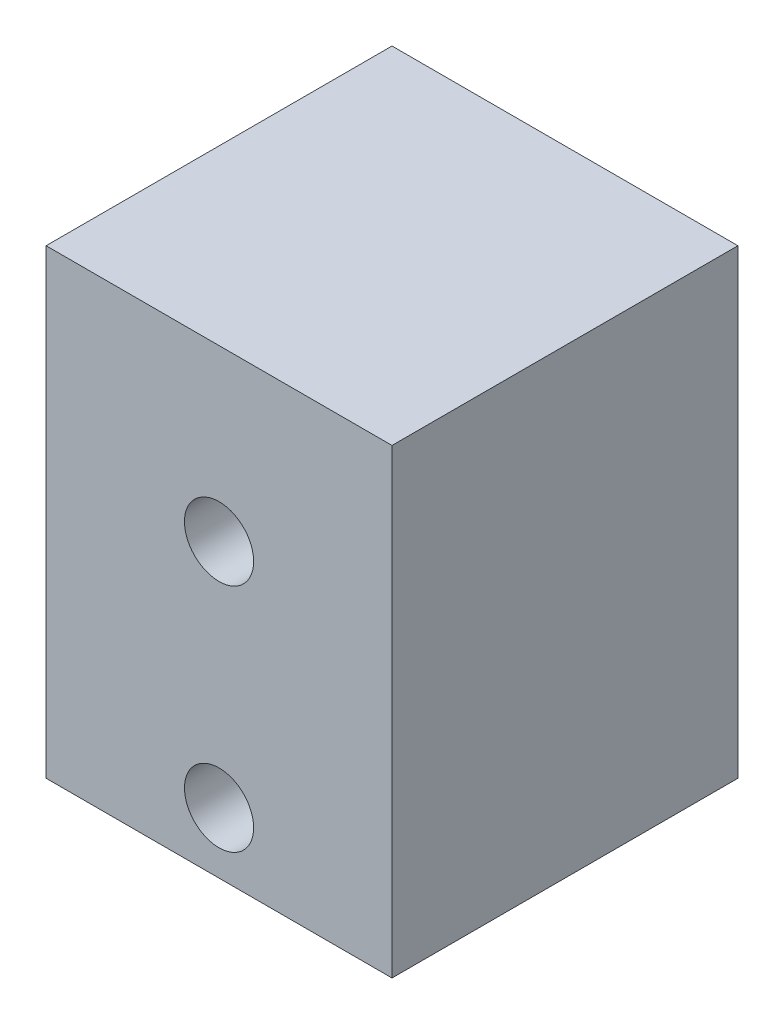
from build123d import *

# Parameters (mm, degrees)
ESQUISSE1_W      = 30
ESQUISSE1_H      = 40
ESQUISSE1_R      = 3
EXTRUSION1_DEPTH = 30


with BuildPart() as part:
    # Esquisse1 → Extrusion1 (new body)
    with BuildSketch(Plane.XY):
        with Locations((15, 20)):
            Rectangle(ESQUISSE1_W, ESQUISSE1_H)
        with Locations((15, 5.28054955)):
            Circle(ESQUISSE1_R, mode=Mode.SUBTRACT)
        with Locations((15, 25.28054955)):
            Circle(ESQUISSE1_R, mode=Mode.SUBTRACT)
    extrude(amount=EXTRUSION1_DEPTH)


solid = part.part
